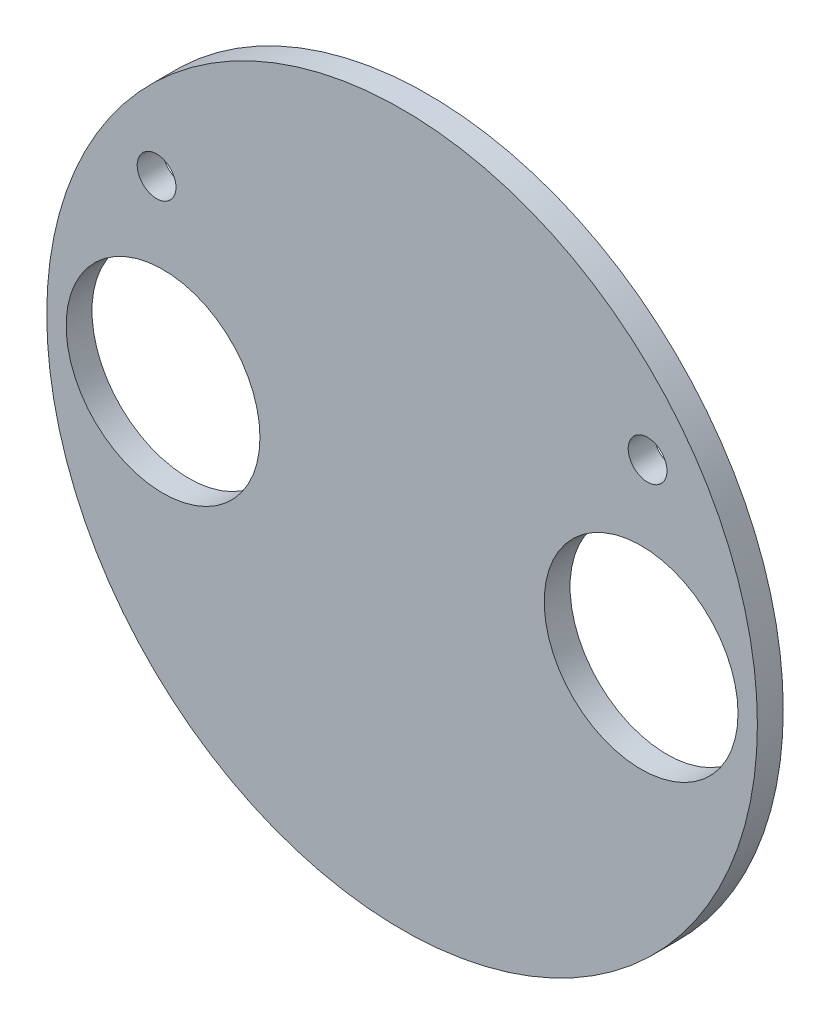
from build123d import *

# Parameters (mm, degrees)
ESQUISSE1_R             = 27.5
EXTRUSION1_DEPTH        = 2
ESQUISSE2_R             = 7.5
ESQUISSE2_R_2           = 1.5
ENL_V_MAT_EXTRU_1_DEPTH = 39.942264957


with BuildPart() as part:
    # Esquisse1 → Extrusion1 (new body)
    with BuildSketch(Plane.XY):
        Circle(ESQUISSE1_R)
    extrude(amount=EXTRUSION1_DEPTH)

    # Esquisse2 → Enl_v. mat.-Extru.1 (cut, through all)
    with BuildSketch(Plane.XY.offset(2)):
        with Locations((-18.5, 0)):
            Circle(ESQUISSE2_R)
        with Locations((-19, 13.5)):
            Circle(ESQUISSE2_R_2)
        with Locations((18.5, 0)):
            Circle(ESQUISSE2_R)
        with Locations((19, 13.5)):
            Circle(ESQUISSE2_R_2)
    extrude(amount=-ENL_V_MAT_EXTRU_1_DEPTH, mode=Mode.SUBTRACT)


solid = part.part
